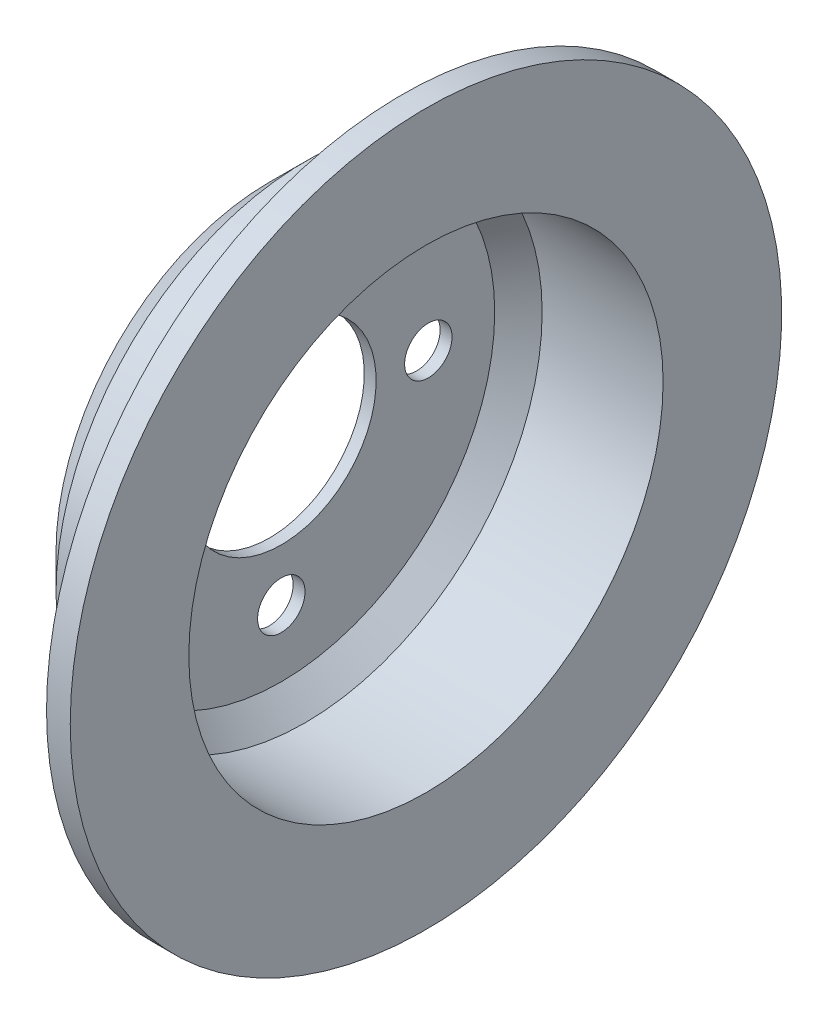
ISO-10303-21;
HEADER;
FILE_DESCRIPTION(('STEP AP214'),'2;1');
FILE_NAME('part.step','',(''),(''),'','','');
FILE_SCHEMA(('AUTOMOTIVE_DESIGN { 1 0 10303 214 1 1 1 1 }'));
ENDSEC;
DATA;
#1=APPLICATION_CONTEXT('core data for automotive mechanical design processes');
#2=APPLICATION_PROTOCOL_DEFINITION('international standard','automotive_design',2000,#1);
#3=PRODUCT_CONTEXT('',#1,'mechanical');
#4=PRODUCT('Part','Part','',(#3));
#5=PRODUCT_RELATED_PRODUCT_CATEGORY('part','',(#4));
#6=PRODUCT_DEFINITION_FORMATION('','',#4);
#7=PRODUCT_DEFINITION_CONTEXT('part definition',#1,'design');
#8=PRODUCT_DEFINITION('design','',#6,#7);
#9=PRODUCT_DEFINITION_SHAPE('','',#8);
#10=(LENGTH_UNIT() NAMED_UNIT(*) SI_UNIT(.MILLI.,.METRE.));
#11=(NAMED_UNIT(*) PLANE_ANGLE_UNIT() SI_UNIT($,.RADIAN.));
#12=(NAMED_UNIT(*) SI_UNIT($,.STERADIAN.) SOLID_ANGLE_UNIT());
#13=UNCERTAINTY_MEASURE_WITH_UNIT(LENGTH_MEASURE(1.E-05),#10,'distance_accuracy_value','');
#14=(GEOMETRIC_REPRESENTATION_CONTEXT(3) GLOBAL_UNCERTAINTY_ASSIGNED_CONTEXT((#13)) GLOBAL_UNIT_ASSIGNED_CONTEXT((#10,
#11,#12)) REPRESENTATION_CONTEXT('',''));
#15=CARTESIAN_POINT('',(0.,0.,0.));
#16=DIRECTION('',(0.,0.,1.));
#17=DIRECTION('',(1.,0.,0.));
#18=AXIS2_PLACEMENT_3D('',#15,#16,#17);
#19=CARTESIAN_POINT('',(0.,90.,0.));
#20=DIRECTION('',(1.,0.,0.));
#21=DIRECTION('',(0.,0.,-1.));
#22=AXIS2_PLACEMENT_3D('',#19,#20,#21);
#23=PLANE('',#22);
#24=CARTESIAN_POINT('',(0.,62.,0.));
#25=DIRECTION('',(1.,0.,0.));
#26=DIRECTION('',(0.,0.,-1.));
#27=AXIS2_PLACEMENT_3D('',#24,#25,#26);
#28=CIRCLE('',#27,9.99999999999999);
#29=CARTESIAN_POINT('',(0.,62.,-9.99999999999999));
#30=VERTEX_POINT('',#29);
#31=EDGE_CURVE('E122',#30,#30,#28,.T.);
#32=ORIENTED_EDGE('',*,*,#31,.T.);
#33=EDGE_LOOP('',(#32));
#34=FACE_BOUND('',#33,.T.);
#35=CARTESIAN_POINT('',(0.,0.,-62.));
#36=DIRECTION('',(1.,0.,0.));
#37=DIRECTION('',(0.,0.,-1.));
#38=AXIS2_PLACEMENT_3D('',#35,#36,#37);
#39=CIRCLE('',#38,10.);
#40=CARTESIAN_POINT('',(0.,0.,-72.));
#41=VERTEX_POINT('',#40);
#42=EDGE_CURVE('E115',#41,#41,#39,.T.);
#43=ORIENTED_EDGE('',*,*,#42,.T.);
#44=EDGE_LOOP('',(#43));
#45=FACE_BOUND('',#44,.T.);
#46=CARTESIAN_POINT('',(0.,0.,62.));
#47=DIRECTION('',(1.,0.,0.));
#48=DIRECTION('',(0.,0.,-1.));
#49=AXIS2_PLACEMENT_3D('',#46,#47,#48);
#50=CIRCLE('',#49,10.);
#51=CARTESIAN_POINT('',(0.,0.,52.));
#52=VERTEX_POINT('',#51);
#53=EDGE_CURVE('E108',#52,#52,#50,.T.);
#54=ORIENTED_EDGE('',*,*,#53,.T.);
#55=EDGE_LOOP('',(#54));
#56=FACE_BOUND('',#55,.T.);
#57=CARTESIAN_POINT('',(0.,-62.,0.));
#58=DIRECTION('',(1.,0.,0.));
#59=DIRECTION('',(0.,0.,-1.));
#60=AXIS2_PLACEMENT_3D('',#57,#58,#59);
#61=CIRCLE('',#60,9.99999999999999);
#62=CARTESIAN_POINT('',(0.,-62.,-9.99999999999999));
#63=VERTEX_POINT('',#62);
#64=EDGE_CURVE('E100',#63,#63,#61,.T.);
#65=ORIENTED_EDGE('',*,*,#64,.T.);
#66=EDGE_LOOP('',(#65));
#67=FACE_BOUND('',#66,.T.);
#68=CARTESIAN_POINT('',(0.,0.,0.));
#69=DIRECTION('',(-1.,0.,0.));
#70=DIRECTION('',(0.,0.,1.));
#71=AXIS2_PLACEMENT_3D('',#68,#69,#70);
#72=CIRCLE('',#71,40.);
#73=CARTESIAN_POINT('',(0.,0.,40.));
#74=VERTEX_POINT('',#73);
#75=EDGE_CURVE('E10',#74,#74,#72,.T.);
#76=ORIENTED_EDGE('',*,*,#75,.F.);
#77=EDGE_LOOP('',(#76));
#78=FACE_BOUND('',#77,.T.);
#79=CARTESIAN_POINT('',(0.,0.,0.));
#80=DIRECTION('',(-1.,0.,0.));
#81=DIRECTION('',(0.,0.,1.));
#82=AXIS2_PLACEMENT_3D('',#79,#80,#81);
#83=CIRCLE('',#82,90.);
#84=CARTESIAN_POINT('',(0.,0.,90.));
#85=VERTEX_POINT('',#84);
#86=EDGE_CURVE('E96',#85,#85,#83,.T.);
#87=ORIENTED_EDGE('',*,*,#86,.T.);
#88=EDGE_LOOP('',(#87));
#89=FACE_BOUND('',#88,.T.);
#90=ADVANCED_FACE('F42',(#34,#45,#56,#67,#78,#89),#23,.F.);
#91=CARTESIAN_POINT('',(0.,0.,0.));
#92=DIRECTION('',(-1.,0.,0.));
#93=DIRECTION('',(0.,0.,1.));
#94=AXIS2_PLACEMENT_3D('',#91,#92,#93);
#95=CYLINDRICAL_SURFACE('',#94,40.);
#96=CARTESIAN_POINT('',(5.00000000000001,0.,0.));
#97=DIRECTION('',(-1.,0.,0.));
#98=DIRECTION('',(0.,0.,1.));
#99=AXIS2_PLACEMENT_3D('',#96,#97,#98);
#100=CIRCLE('',#99,40.);
#101=CARTESIAN_POINT('',(5.00000000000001,0.,40.));
#102=VERTEX_POINT('',#101);
#103=EDGE_CURVE('E49',#102,#102,#100,.T.);
#104=ORIENTED_EDGE('',*,*,#103,.F.);
#105=EDGE_LOOP('',(#104));
#106=FACE_BOUND('',#105,.T.);
#107=ORIENTED_EDGE('',*,*,#75,.T.);
#108=EDGE_LOOP('',(#107));
#109=FACE_BOUND('',#108,.T.);
#110=ADVANCED_FACE('F136',(#106,#109),#95,.F.);
#111=CARTESIAN_POINT('',(5.00000000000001,40.,0.));
#112=DIRECTION('',(-1.,0.,0.));
#113=DIRECTION('',(0.,0.,1.));
#114=AXIS2_PLACEMENT_3D('',#111,#112,#113);
#115=PLANE('',#114);
#116=CARTESIAN_POINT('',(5.00000000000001,62.,0.));
#117=DIRECTION('',(1.,0.,0.));
#118=DIRECTION('',(0.,0.,-1.));
#119=AXIS2_PLACEMENT_3D('',#116,#117,#118);
#120=CIRCLE('',#119,9.99999999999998);
#121=CARTESIAN_POINT('',(5.00000000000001,62.,-9.99999999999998));
#122=VERTEX_POINT('',#121);
#123=EDGE_CURVE('E125',#122,#122,#120,.T.);
#124=ORIENTED_EDGE('',*,*,#123,.F.);
#125=EDGE_LOOP('',(#124));
#126=FACE_BOUND('',#125,.T.);
#127=CARTESIAN_POINT('',(5.00000000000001,0.,-62.));
#128=DIRECTION('',(1.,0.,0.));
#129=DIRECTION('',(0.,0.,-1.));
#130=AXIS2_PLACEMENT_3D('',#127,#128,#129);
#131=CIRCLE('',#130,9.99999999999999);
#132=CARTESIAN_POINT('',(5.00000000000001,0.,-72.));
#133=VERTEX_POINT('',#132);
#134=EDGE_CURVE('E118',#133,#133,#131,.T.);
#135=ORIENTED_EDGE('',*,*,#134,.F.);
#136=EDGE_LOOP('',(#135));
#137=FACE_BOUND('',#136,.T.);
#138=CARTESIAN_POINT('',(5.00000000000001,0.,62.));
#139=DIRECTION('',(1.,0.,0.));
#140=DIRECTION('',(0.,0.,-1.));
#141=AXIS2_PLACEMENT_3D('',#138,#139,#140);
#142=CIRCLE('',#141,9.99999999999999);
#143=CARTESIAN_POINT('',(5.00000000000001,0.,52.));
#144=VERTEX_POINT('',#143);
#145=EDGE_CURVE('E111',#144,#144,#142,.T.);
#146=ORIENTED_EDGE('',*,*,#145,.F.);
#147=EDGE_LOOP('',(#146));
#148=FACE_BOUND('',#147,.T.);
#149=CARTESIAN_POINT('',(5.00000000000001,-62.,0.));
#150=DIRECTION('',(1.,0.,0.));
#151=DIRECTION('',(0.,0.,-1.));
#152=AXIS2_PLACEMENT_3D('',#149,#150,#151);
#153=CIRCLE('',#152,9.99999999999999);
#154=CARTESIAN_POINT('',(5.00000000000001,-62.,-9.99999999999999));
#155=VERTEX_POINT('',#154);
#156=EDGE_CURVE('E104',#155,#155,#153,.T.);
#157=ORIENTED_EDGE('',*,*,#156,.F.);
#158=EDGE_LOOP('',(#157));
#159=FACE_BOUND('',#158,.T.);
#160=CARTESIAN_POINT('',(5.00000000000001,0.,0.));
#161=DIRECTION('',(-1.,0.,0.));
#162=DIRECTION('',(0.,0.,1.));
#163=AXIS2_PLACEMENT_3D('',#160,#161,#162);
#164=CIRCLE('',#163,90.);
#165=CARTESIAN_POINT('',(5.00000000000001,0.,90.));
#166=VERTEX_POINT('',#165);
#167=EDGE_CURVE('E56',#166,#166,#164,.T.);
#168=ORIENTED_EDGE('',*,*,#167,.F.);
#169=EDGE_LOOP('',(#168));
#170=FACE_BOUND('',#169,.T.);
#171=ORIENTED_EDGE('',*,*,#103,.T.);
#172=EDGE_LOOP('',(#171));
#173=FACE_BOUND('',#172,.T.);
#174=ADVANCED_FACE('F132',(#126,#137,#148,#159,#170,#173),#115,.F.);
#175=CARTESIAN_POINT('',(5.00000000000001,0.,0.));
#176=DIRECTION('',(1.,0.,0.));
#177=DIRECTION('',(0.,0.,-1.));
#178=AXIS2_PLACEMENT_3D('',#175,#176,#177);
#179=CONICAL_SURFACE('',#178,90.,0.78539816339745);
#180=CARTESIAN_POINT('',(15.,0.,0.));
#181=DIRECTION('',(-1.,0.,0.));
#182=DIRECTION('',(0.,0.,1.));
#183=AXIS2_PLACEMENT_3D('',#180,#181,#182);
#184=CIRCLE('',#183,100.);
#185=CARTESIAN_POINT('',(15.,0.,100.));
#186=VERTEX_POINT('',#185);
#187=EDGE_CURVE('E63',#186,#186,#184,.T.);
#188=ORIENTED_EDGE('',*,*,#187,.F.);
#189=EDGE_LOOP('',(#188));
#190=FACE_BOUND('',#189,.T.);
#191=ORIENTED_EDGE('',*,*,#167,.T.);
#192=EDGE_LOOP('',(#191));
#193=FACE_BOUND('',#192,.T.);
#194=ADVANCED_FACE('F135',(#190,#193),#179,.F.);
#195=CARTESIAN_POINT('',(0.,0.,0.));
#196=DIRECTION('',(-1.,0.,0.));
#197=DIRECTION('',(0.,0.,1.));
#198=AXIS2_PLACEMENT_3D('',#195,#196,#197);
#199=CYLINDRICAL_SURFACE('',#198,100.);
#200=CARTESIAN_POINT('',(66.,0.,0.));
#201=DIRECTION('',(-1.,0.,0.));
#202=DIRECTION('',(0.,0.,1.));
#203=AXIS2_PLACEMENT_3D('',#200,#201,#202);
#204=CIRCLE('',#203,100.);
#205=CARTESIAN_POINT('',(66.,0.,100.));
#206=VERTEX_POINT('',#205);
#207=EDGE_CURVE('E68',#206,#206,#204,.T.);
#208=ORIENTED_EDGE('',*,*,#207,.F.);
#209=EDGE_LOOP('',(#208));
#210=FACE_BOUND('',#209,.T.);
#211=ORIENTED_EDGE('',*,*,#187,.T.);
#212=EDGE_LOOP('',(#211));
#213=FACE_BOUND('',#212,.T.);
#214=ADVANCED_FACE('F147',(#210,#213),#199,.F.);
#215=CARTESIAN_POINT('',(66.,100.,0.));
#216=DIRECTION('',(-1.,0.,0.));
#217=DIRECTION('',(0.,0.,1.));
#218=AXIS2_PLACEMENT_3D('',#215,#216,#217);
#219=PLANE('',#218);
#220=CARTESIAN_POINT('',(66.,0.,0.));
#221=DIRECTION('',(-1.,0.,0.));
#222=DIRECTION('',(0.,0.,1.));
#223=AXIS2_PLACEMENT_3D('',#220,#221,#222);
#224=CIRCLE('',#223,150.);
#225=CARTESIAN_POINT('',(66.,0.,150.));
#226=VERTEX_POINT('',#225);
#227=EDGE_CURVE('E72',#226,#226,#224,.T.);
#228=ORIENTED_EDGE('',*,*,#227,.F.);
#229=EDGE_LOOP('',(#228));
#230=FACE_BOUND('',#229,.T.);
#231=ORIENTED_EDGE('',*,*,#207,.T.);
#232=EDGE_LOOP('',(#231));
#233=FACE_BOUND('',#232,.T.);
#234=ADVANCED_FACE('F153',(#230,#233),#219,.F.);
#235=CARTESIAN_POINT('',(0.,0.,0.));
#236=DIRECTION('',(-1.,0.,0.));
#237=DIRECTION('',(0.,0.,1.));
#238=AXIS2_PLACEMENT_3D('',#235,#236,#237);
#239=CYLINDRICAL_SURFACE('',#238,150.);
#240=CARTESIAN_POINT('',(56.,0.,0.));
#241=DIRECTION('',(-1.,0.,0.));
#242=DIRECTION('',(0.,0.,1.));
#243=AXIS2_PLACEMENT_3D('',#240,#241,#242);
#244=CIRCLE('',#243,150.);
#245=CARTESIAN_POINT('',(56.,0.,150.));
#246=VERTEX_POINT('',#245);
#247=EDGE_CURVE('E76',#246,#246,#244,.T.);
#248=ORIENTED_EDGE('',*,*,#247,.F.);
#249=EDGE_LOOP('',(#248));
#250=FACE_BOUND('',#249,.T.);
#251=ORIENTED_EDGE('',*,*,#227,.T.);
#252=EDGE_LOOP('',(#251));
#253=FACE_BOUND('',#252,.T.);
#254=ADVANCED_FACE('F202',(#250,#253),#239,.T.);
#255=CARTESIAN_POINT('',(56.,150.,0.));
#256=DIRECTION('',(1.,0.,0.));
#257=DIRECTION('',(0.,0.,-1.));
#258=AXIS2_PLACEMENT_3D('',#255,#256,#257);
#259=PLANE('',#258);
#260=CARTESIAN_POINT('',(56.,0.,0.));
#261=DIRECTION('',(-1.,0.,0.));
#262=DIRECTION('',(0.,0.,1.));
#263=AXIS2_PLACEMENT_3D('',#260,#261,#262);
#264=CIRCLE('',#263,110.);
#265=CARTESIAN_POINT('',(56.,0.,110.));
#266=VERTEX_POINT('',#265);
#267=EDGE_CURVE('E80',#266,#266,#264,.T.);
#268=ORIENTED_EDGE('',*,*,#267,.F.);
#269=EDGE_LOOP('',(#268));
#270=FACE_BOUND('',#269,.T.);
#271=ORIENTED_EDGE('',*,*,#247,.T.);
#272=EDGE_LOOP('',(#271));
#273=FACE_BOUND('',#272,.T.);
#274=ADVANCED_FACE('F196',(#270,#273),#259,.F.);
#275=CARTESIAN_POINT('',(0.,0.,0.));
#276=DIRECTION('',(-1.,0.,0.));
#277=DIRECTION('',(0.,0.,1.));
#278=AXIS2_PLACEMENT_3D('',#275,#276,#277);
#279=CYLINDRICAL_SURFACE('',#278,110.);
#280=CARTESIAN_POINT('',(61.,0.,0.));
#281=DIRECTION('',(-1.,0.,0.));
#282=DIRECTION('',(0.,0.,1.));
#283=AXIS2_PLACEMENT_3D('',#280,#281,#282);
#284=CIRCLE('',#283,110.);
#285=CARTESIAN_POINT('',(61.,0.,110.));
#286=VERTEX_POINT('',#285);
#287=EDGE_CURVE('E84',#286,#286,#284,.T.);
#288=ORIENTED_EDGE('',*,*,#287,.F.);
#289=EDGE_LOOP('',(#288));
#290=FACE_BOUND('',#289,.T.);
#291=ORIENTED_EDGE('',*,*,#267,.T.);
#292=EDGE_LOOP('',(#291));
#293=FACE_BOUND('',#292,.T.);
#294=ADVANCED_FACE('F190',(#290,#293),#279,.F.);
#295=CARTESIAN_POINT('',(61.,110.,0.));
#296=DIRECTION('',(1.,0.,0.));
#297=DIRECTION('',(0.,0.,-1.));
#298=AXIS2_PLACEMENT_3D('',#295,#296,#297);
#299=PLANE('',#298);
#300=CARTESIAN_POINT('',(61.,0.,0.));
#301=DIRECTION('',(-1.,0.,0.));
#302=DIRECTION('',(0.,0.,1.));
#303=AXIS2_PLACEMENT_3D('',#300,#301,#302);
#304=CIRCLE('',#303,105.);
#305=CARTESIAN_POINT('',(61.,0.,105.));
#306=VERTEX_POINT('',#305);
#307=EDGE_CURVE('E88',#306,#306,#304,.T.);
#308=ORIENTED_EDGE('',*,*,#307,.F.);
#309=EDGE_LOOP('',(#308));
#310=FACE_BOUND('',#309,.T.);
#311=ORIENTED_EDGE('',*,*,#287,.T.);
#312=EDGE_LOOP('',(#311));
#313=FACE_BOUND('',#312,.T.);
#314=ADVANCED_FACE('F184',(#310,#313),#299,.F.);
#315=CARTESIAN_POINT('',(0.,0.,0.));
#316=DIRECTION('',(-1.,0.,0.));
#317=DIRECTION('',(0.,0.,1.));
#318=AXIS2_PLACEMENT_3D('',#315,#316,#317);
#319=CYLINDRICAL_SURFACE('',#318,105.);
#320=CARTESIAN_POINT('',(14.9999999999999,0.,0.));
#321=DIRECTION('',(-1.,0.,0.));
#322=DIRECTION('',(0.,0.,1.));
#323=AXIS2_PLACEMENT_3D('',#320,#321,#322);
#324=CIRCLE('',#323,105.);
#325=CARTESIAN_POINT('',(14.9999999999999,0.,105.));
#326=VERTEX_POINT('',#325);
#327=EDGE_CURVE('E92',#326,#326,#324,.T.);
#328=ORIENTED_EDGE('',*,*,#327,.F.);
#329=EDGE_LOOP('',(#328));
#330=FACE_BOUND('',#329,.T.);
#331=ORIENTED_EDGE('',*,*,#307,.T.);
#332=EDGE_LOOP('',(#331));
#333=FACE_BOUND('',#332,.T.);
#334=ADVANCED_FACE('F178',(#330,#333),#319,.T.);
#335=CARTESIAN_POINT('',(14.9999999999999,0.,0.));
#336=DIRECTION('',(1.,0.,0.));
#337=DIRECTION('',(0.,0.,-1.));
#338=AXIS2_PLACEMENT_3D('',#335,#336,#337);
#339=CONICAL_SURFACE('',#338,105.,0.785398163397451);
#340=ORIENTED_EDGE('',*,*,#86,.F.);
#341=EDGE_LOOP('',(#340));
#342=FACE_BOUND('',#341,.T.);
#343=ORIENTED_EDGE('',*,*,#327,.T.);
#344=EDGE_LOOP('',(#343));
#345=FACE_BOUND('',#344,.T.);
#346=ADVANCED_FACE('F174',(#342,#345),#339,.T.);
#347=CARTESIAN_POINT('',(5.00000000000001,-62.,0.));
#348=DIRECTION('',(1.,0.,0.));
#349=DIRECTION('',(0.,0.,-1.));
#350=AXIS2_PLACEMENT_3D('',#347,#348,#349);
#351=CYLINDRICAL_SURFACE('',#350,9.99999999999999);
#352=ORIENTED_EDGE('',*,*,#64,.F.);
#353=EDGE_LOOP('',(#352));
#354=FACE_BOUND('',#353,.T.);
#355=ORIENTED_EDGE('',*,*,#156,.T.);
#356=EDGE_LOOP('',(#355));
#357=FACE_BOUND('',#356,.T.);
#358=ADVANCED_FACE('F177',(#354,#357),#351,.F.);
#359=CARTESIAN_POINT('',(5.00000000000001,0.,62.));
#360=DIRECTION('',(1.,0.,0.));
#361=DIRECTION('',(0.,0.,-1.));
#362=AXIS2_PLACEMENT_3D('',#359,#360,#361);
#363=CYLINDRICAL_SURFACE('',#362,9.99999999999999);
#364=ORIENTED_EDGE('',*,*,#53,.F.);
#365=EDGE_LOOP('',(#364));
#366=FACE_BOUND('',#365,.T.);
#367=ORIENTED_EDGE('',*,*,#145,.T.);
#368=EDGE_LOOP('',(#367));
#369=FACE_BOUND('',#368,.T.);
#370=ADVANCED_FACE('F221',(#366,#369),#363,.F.);
#371=CARTESIAN_POINT('',(5.00000000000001,0.,-62.));
#372=DIRECTION('',(1.,0.,0.));
#373=DIRECTION('',(0.,0.,-1.));
#374=AXIS2_PLACEMENT_3D('',#371,#372,#373);
#375=CYLINDRICAL_SURFACE('',#374,9.99999999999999);
#376=ORIENTED_EDGE('',*,*,#42,.F.);
#377=EDGE_LOOP('',(#376));
#378=FACE_BOUND('',#377,.T.);
#379=ORIENTED_EDGE('',*,*,#134,.T.);
#380=EDGE_LOOP('',(#379));
#381=FACE_BOUND('',#380,.T.);
#382=ADVANCED_FACE('F225',(#378,#381),#375,.F.);
#383=CARTESIAN_POINT('',(5.00000000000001,62.,0.));
#384=DIRECTION('',(1.,0.,0.));
#385=DIRECTION('',(0.,0.,-1.));
#386=AXIS2_PLACEMENT_3D('',#383,#384,#385);
#387=CYLINDRICAL_SURFACE('',#386,9.99999999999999);
#388=ORIENTED_EDGE('',*,*,#31,.F.);
#389=EDGE_LOOP('',(#388));
#390=FACE_BOUND('',#389,.T.);
#391=ORIENTED_EDGE('',*,*,#123,.T.);
#392=EDGE_LOOP('',(#391));
#393=FACE_BOUND('',#392,.T.);
#394=ADVANCED_FACE('F130',(#390,#393),#387,.F.);
#395=CLOSED_SHELL('',(#90,#110,#174,#194,#214,#234,#254,#274,#294,#314,#334,#346,#358,#370,#382,#394));
#396=MANIFOLD_SOLID_BREP('B2',#395);
#397=ADVANCED_BREP_SHAPE_REPRESENTATION('',(#18,#396),#14);
#398=SHAPE_DEFINITION_REPRESENTATION(#9,#397);
ENDSEC;
END-ISO-10303-21;
